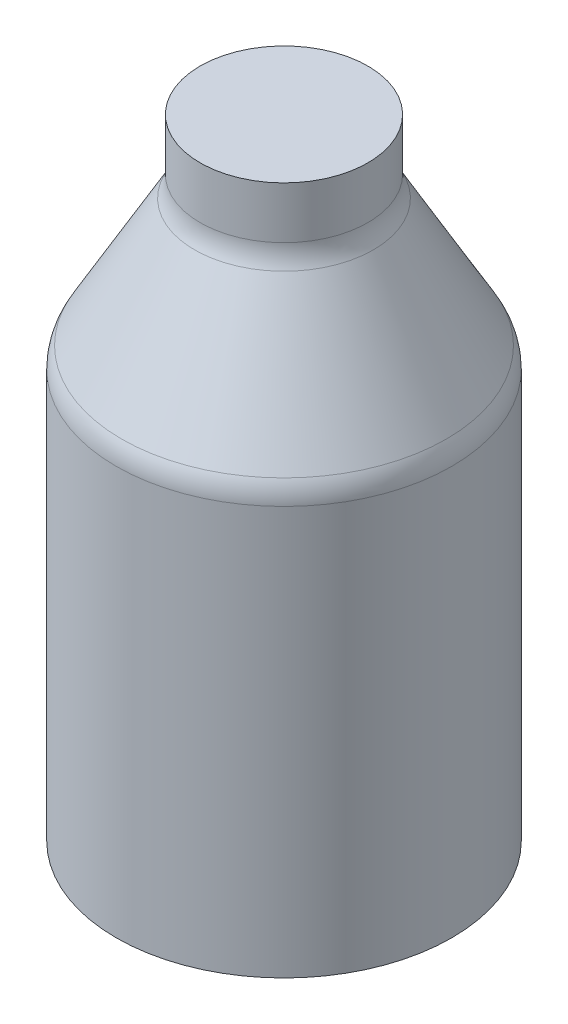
from build123d import *

# Parameters (mm, degrees)
CONG_1_R = 10


with BuildPart() as part:
    # Esquisse1 → R_volution1 (revolve)
    with BuildSketch(Plane.XY):
        Polygon((0, 0), (-40, 0), (-40, 100), (-20, 135), (-20, 150), (0, 150), align=None)
    revolve(axis=Axis((0, 150, 0), (0, -1, 0)))

    # Cong_1
    cong_1_edges = [part.edges().sort_by_distance(p)[0] for p in [
        (20, 135, 0),
        (40, 100, 0),
    ]]
    fillet(cong_1_edges, radius=CONG_1_R)


solid = part.part
